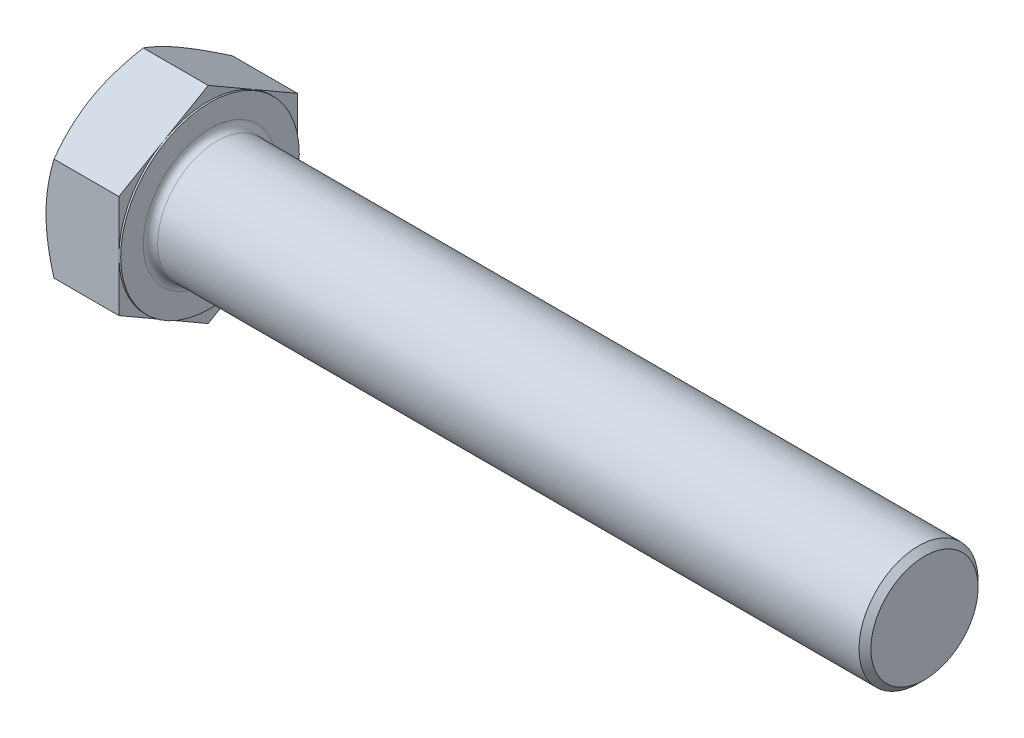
ISO-10303-21;
HEADER;
FILE_DESCRIPTION(('STEP AP214'),'2;1');
FILE_NAME('part.step','',(''),(''),'','','');
FILE_SCHEMA(('AUTOMOTIVE_DESIGN { 1 0 10303 214 1 1 1 1 }'));
ENDSEC;
DATA;
#1=APPLICATION_CONTEXT('core data for automotive mechanical design processes');
#2=APPLICATION_PROTOCOL_DEFINITION('international standard','automotive_design',2000,#1);
#3=PRODUCT_CONTEXT('',#1,'mechanical');
#4=PRODUCT('Part','Part','',(#3));
#5=PRODUCT_RELATED_PRODUCT_CATEGORY('part','',(#4));
#6=PRODUCT_DEFINITION_FORMATION('','',#4);
#7=PRODUCT_DEFINITION_CONTEXT('part definition',#1,'design');
#8=PRODUCT_DEFINITION('design','',#6,#7);
#9=PRODUCT_DEFINITION_SHAPE('','',#8);
#10=(LENGTH_UNIT() NAMED_UNIT(*) SI_UNIT(.MILLI.,.METRE.));
#11=(NAMED_UNIT(*) PLANE_ANGLE_UNIT() SI_UNIT($,.RADIAN.));
#12=(NAMED_UNIT(*) SI_UNIT($,.STERADIAN.) SOLID_ANGLE_UNIT());
#13=UNCERTAINTY_MEASURE_WITH_UNIT(LENGTH_MEASURE(1.E-05),#10,'distance_accuracy_value','');
#14=(GEOMETRIC_REPRESENTATION_CONTEXT(3) GLOBAL_UNCERTAINTY_ASSIGNED_CONTEXT((#13)) GLOBAL_UNIT_ASSIGNED_CONTEXT((#10,
#11,#12)) REPRESENTATION_CONTEXT('',''));
#15=CARTESIAN_POINT('',(0.,0.,0.));
#16=DIRECTION('',(0.,0.,1.));
#17=DIRECTION('',(1.,0.,0.));
#18=AXIS2_PLACEMENT_3D('',#15,#16,#17);
#19=CARTESIAN_POINT('',(15.9258,21.9970452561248,0.));
#20=DIRECTION('',(1.,0.,0.));
#21=DIRECTION('',(0.,0.,-1.));
#22=AXIS2_PLACEMENT_3D('',#19,#20,#21);
#23=PLANE('',#22);
#24=CARTESIAN_POINT('',(15.9258,0.,0.));
#25=DIRECTION('',(1.,0.,0.));
#26=DIRECTION('',(0.,0.,-1.));
#27=AXIS2_PLACEMENT_3D('',#24,#25,#26);
#28=CIRCLE('',#27,14.224);
#29=CARTESIAN_POINT('',(15.9258,0.,-14.224));
#30=VERTEX_POINT('',#29);
#31=EDGE_CURVE('E41',#30,#30,#28,.F.);
#32=ORIENTED_EDGE('',*,*,#31,.T.);
#33=EDGE_LOOP('',(#32));
#34=FACE_BOUND('',#33,.T.);
#35=CARTESIAN_POINT('',(15.9258,0.,0.));
#36=DIRECTION('',(1.,0.,0.));
#37=DIRECTION('',(0.,0.,-1.));
#38=AXIS2_PLACEMENT_3D('',#35,#36,#37);
#39=CIRCLE('',#38,19.05);
#40=CARTESIAN_POINT('',(15.9258,0.,-19.05));
#41=VERTEX_POINT('',#40);
#42=EDGE_CURVE('E298',#41,#41,#39,.T.);
#43=ORIENTED_EDGE('',*,*,#42,.T.);
#44=EDGE_LOOP('',(#43));
#45=FACE_BOUND('',#44,.T.);
#46=ADVANCED_FACE('F33',(#34,#45),#23,.T.);
#47=CARTESIAN_POINT('',(0.,0.,0.));
#48=DIRECTION('',(-1.,0.,0.));
#49=DIRECTION('',(0.,0.,1.));
#50=AXIS2_PLACEMENT_3D('',#47,#48,#49);
#51=CYLINDRICAL_SURFACE('',#50,12.7);
#52=CARTESIAN_POINT('',(17.4498,0.,0.));
#53=DIRECTION('',(1.,0.,0.));
#54=DIRECTION('',(0.,0.,-1.));
#55=AXIS2_PLACEMENT_3D('',#52,#53,#54);
#56=CIRCLE('',#55,12.7);
#57=CARTESIAN_POINT('',(17.4498,0.,-12.7));
#58=VERTEX_POINT('',#57);
#59=EDGE_CURVE('E11',#58,#58,#56,.T.);
#60=ORIENTED_EDGE('',*,*,#59,.T.);
#61=EDGE_LOOP('',(#60));
#62=FACE_BOUND('',#61,.T.);
#63=CARTESIAN_POINT('',(167.05707,0.,0.));
#64=DIRECTION('',(-1.,0.,0.));
#65=DIRECTION('',(0.,0.,1.));
#66=AXIS2_PLACEMENT_3D('',#63,#64,#65);
#67=CIRCLE('',#66,12.7);
#68=CARTESIAN_POINT('',(167.05707,0.,12.7));
#69=VERTEX_POINT('',#68);
#70=EDGE_CURVE('E277',#69,#69,#67,.T.);
#71=ORIENTED_EDGE('',*,*,#70,.T.);
#72=EDGE_LOOP('',(#71));
#73=FACE_BOUND('',#72,.T.);
#74=ADVANCED_FACE('F251',(#62,#73),#51,.T.);
#75=CARTESIAN_POINT('',(168.3258,0.,0.));
#76=DIRECTION('',(-1.,0.,0.));
#77=DIRECTION('',(0.,0.,1.));
#78=AXIS2_PLACEMENT_3D('',#75,#76,#77);
#79=CONICAL_SURFACE('',#78,11.43127,0.785398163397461);
#80=ORIENTED_EDGE('',*,*,#70,.F.);
#81=EDGE_LOOP('',(#80));
#82=FACE_BOUND('',#81,.T.);
#83=CARTESIAN_POINT('',(168.3258,0.,0.));
#84=DIRECTION('',(-1.,0.,0.));
#85=DIRECTION('',(0.,0.,1.));
#86=AXIS2_PLACEMENT_3D('',#83,#84,#85);
#87=CIRCLE('',#86,11.43127);
#88=CARTESIAN_POINT('',(168.3258,0.,11.43127));
#89=VERTEX_POINT('',#88);
#90=EDGE_CURVE('E275',#89,#89,#87,.T.);
#91=ORIENTED_EDGE('',*,*,#90,.T.);
#92=EDGE_LOOP('',(#91));
#93=FACE_BOUND('',#92,.T.);
#94=ADVANCED_FACE('F256',(#82,#93),#79,.T.);
#95=CARTESIAN_POINT('',(168.3258,0.,0.));
#96=DIRECTION('',(-1.,0.,0.));
#97=DIRECTION('',(0.,0.,1.));
#98=AXIS2_PLACEMENT_3D('',#95,#96,#97);
#99=PLANE('',#98);
#100=ORIENTED_EDGE('',*,*,#90,.F.);
#101=EDGE_LOOP('',(#100));
#102=FACE_BOUND('',#101,.T.);
#103=ADVANCED_FACE('F263',(#102),#99,.F.);
#104=CARTESIAN_POINT('',(15.5448,19.05,0.));
#105=DIRECTION('',(1.,0.,0.));
#106=DIRECTION('',(0.,0.,-1.));
#107=AXIS2_PLACEMENT_3D('',#104,#105,#106);
#108=PLANE('',#107);
#109=DIRECTION('',(0.,0.500000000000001,0.866025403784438));
#110=VECTOR('',#109,1.);
#111=CARTESIAN_POINT('',(15.5448,10.9985226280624,-19.05));
#112=LINE('',#111,#110);
#113=CARTESIAN_POINT('',(15.5448,10.9985226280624,-19.05));
#114=VERTEX_POINT('',#113);
#115=CARTESIAN_POINT('',(15.5448,16.4977839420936,-9.52500000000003));
#116=VERTEX_POINT('',#115);
#117=EDGE_CURVE('E165',#114,#116,#112,.T.);
#118=ORIENTED_EDGE('',*,*,#117,.T.);
#119=CARTESIAN_POINT('',(15.5448,0.,0.));
#120=DIRECTION('',(-1.,0.,0.));
#121=DIRECTION('',(0.,0.,1.));
#122=AXIS2_PLACEMENT_3D('',#119,#120,#121);
#123=CIRCLE('',#122,19.05);
#124=CARTESIAN_POINT('',(15.5448,0.,-19.05));
#125=VERTEX_POINT('',#124);
#126=EDGE_CURVE('E48',#116,#125,#123,.T.);
#127=ORIENTED_EDGE('',*,*,#126,.T.);
#128=DIRECTION('',(0.,1.,0.));
#129=VECTOR('',#128,1.);
#130=CARTESIAN_POINT('',(15.5448,10.9985226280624,-19.05));
#131=LINE('',#130,#129);
#132=EDGE_CURVE('E301',#125,#114,#131,.T.);
#133=ORIENTED_EDGE('',*,*,#132,.T.);
#134=EDGE_LOOP('',(#118,#127,#133));
#135=FACE_BOUND('',#134,.T.);
#136=ADVANCED_FACE('F266',(#135),#108,.T.);
#137=CARTESIAN_POINT('',(15.5448,21.9970452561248,0.));
#138=VERTEX_POINT('',#137);
#139=EDGE_CURVE('E163',#116,#138,#112,.T.);
#140=ORIENTED_EDGE('',*,*,#139,.T.);
#141=DIRECTION('',(0.,-0.500000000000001,0.866025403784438));
#142=VECTOR('',#141,1.);
#143=CARTESIAN_POINT('',(15.5448,21.9970452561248,0.));
#144=LINE('',#143,#142);
#145=CARTESIAN_POINT('',(15.5448,16.4977839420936,9.52500000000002));
#146=VERTEX_POINT('',#145);
#147=EDGE_CURVE('E162',#138,#146,#144,.T.);
#148=ORIENTED_EDGE('',*,*,#147,.T.);
#149=EDGE_CURVE('E151',#146,#116,#123,.T.);
#150=ORIENTED_EDGE('',*,*,#149,.T.);
#151=EDGE_LOOP('',(#140,#148,#150));
#152=FACE_BOUND('',#151,.T.);
#153=ADVANCED_FACE('F271',(#152),#108,.T.);
#154=CARTESIAN_POINT('',(15.5448,10.9985226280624,19.05));
#155=VERTEX_POINT('',#154);
#156=EDGE_CURVE('E130',#146,#155,#144,.T.);
#157=ORIENTED_EDGE('',*,*,#156,.T.);
#158=DIRECTION('',(0.,-1.,0.));
#159=VECTOR('',#158,1.);
#160=CARTESIAN_POINT('',(15.5448,10.9985226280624,19.05));
#161=LINE('',#160,#159);
#162=CARTESIAN_POINT('',(15.5448,0.,19.05));
#163=VERTEX_POINT('',#162);
#164=EDGE_CURVE('E124',#155,#163,#161,.T.);
#165=ORIENTED_EDGE('',*,*,#164,.T.);
#166=EDGE_CURVE('E128',#163,#146,#123,.T.);
#167=ORIENTED_EDGE('',*,*,#166,.T.);
#168=EDGE_LOOP('',(#157,#165,#167));
#169=FACE_BOUND('',#168,.T.);
#170=ADVANCED_FACE('F126',(#169),#108,.T.);
#171=CARTESIAN_POINT('',(15.5448,-10.9985226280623,19.05));
#172=VERTEX_POINT('',#171);
#173=EDGE_CURVE('E134',#163,#172,#161,.T.);
#174=ORIENTED_EDGE('',*,*,#173,.T.);
#175=DIRECTION('',(0.,-0.500000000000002,-0.866025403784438));
#176=VECTOR('',#175,1.);
#177=CARTESIAN_POINT('',(15.5448,-21.9970452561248,0.));
#178=LINE('',#177,#176);
#179=CARTESIAN_POINT('',(15.5448,-16.4977839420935,9.52500000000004));
#180=VERTEX_POINT('',#179);
#181=EDGE_CURVE('E141',#172,#180,#178,.T.);
#182=ORIENTED_EDGE('',*,*,#181,.T.);
#183=EDGE_CURVE('E138',#180,#163,#123,.T.);
#184=ORIENTED_EDGE('',*,*,#183,.T.);
#185=EDGE_LOOP('',(#174,#182,#184));
#186=FACE_BOUND('',#185,.T.);
#187=ADVANCED_FACE('F139',(#186),#108,.T.);
#188=CARTESIAN_POINT('',(15.5448,-21.9970452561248,0.));
#189=VERTEX_POINT('',#188);
#190=EDGE_CURVE('E157',#180,#189,#178,.T.);
#191=ORIENTED_EDGE('',*,*,#190,.T.);
#192=DIRECTION('',(0.,0.5,-0.866025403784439));
#193=VECTOR('',#192,1.);
#194=CARTESIAN_POINT('',(15.5448,-10.9985226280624,-19.05));
#195=LINE('',#194,#193);
#196=CARTESIAN_POINT('',(15.5448,-16.4977839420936,-9.525));
#197=VERTEX_POINT('',#196);
#198=EDGE_CURVE('E339',#189,#197,#195,.T.);
#199=ORIENTED_EDGE('',*,*,#198,.T.);
#200=EDGE_CURVE('E145',#197,#180,#123,.T.);
#201=ORIENTED_EDGE('',*,*,#200,.T.);
#202=EDGE_LOOP('',(#191,#199,#201));
#203=FACE_BOUND('',#202,.T.);
#204=ADVANCED_FACE('F340',(#203),#108,.T.);
#205=CARTESIAN_POINT('',(15.5448,-10.9985226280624,-19.05));
#206=VERTEX_POINT('',#205);
#207=EDGE_CURVE('E152',#197,#206,#195,.T.);
#208=ORIENTED_EDGE('',*,*,#207,.T.);
#209=EDGE_CURVE('E302',#206,#125,#131,.T.);
#210=ORIENTED_EDGE('',*,*,#209,.T.);
#211=EDGE_CURVE('E309',#125,#197,#123,.T.);
#212=ORIENTED_EDGE('',*,*,#211,.T.);
#213=EDGE_LOOP('',(#208,#210,#212));
#214=FACE_BOUND('',#213,.T.);
#215=ADVANCED_FACE('F272',(#214),#108,.T.);
#216=CARTESIAN_POINT('',(0.,0.,0.));
#217=DIRECTION('',(-1.,0.,0.));
#218=DIRECTION('',(0.,0.,1.));
#219=AXIS2_PLACEMENT_3D('',#216,#217,#218);
#220=CYLINDRICAL_SURFACE('',#219,19.05);
#221=ORIENTED_EDGE('',*,*,#126,.F.);
#222=ORIENTED_EDGE('',*,*,#149,.F.);
#223=ORIENTED_EDGE('',*,*,#166,.F.);
#224=ORIENTED_EDGE('',*,*,#183,.F.);
#225=ORIENTED_EDGE('',*,*,#200,.F.);
#226=ORIENTED_EDGE('',*,*,#211,.F.);
#227=EDGE_LOOP('',(#221,#222,#223,#224,#225,#226));
#228=FACE_BOUND('',#227,.T.);
#229=ORIENTED_EDGE('',*,*,#42,.F.);
#230=EDGE_LOOP('',(#229));
#231=FACE_BOUND('',#230,.T.);
#232=ADVANCED_FACE('F148',(#228,#231),#220,.T.);
#233=CARTESIAN_POINT('',(0.,21.9970452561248,0.));
#234=DIRECTION('',(1.,0.,0.));
#235=DIRECTION('',(0.,0.,-1.));
#236=AXIS2_PLACEMENT_3D('',#233,#234,#235);
#237=PLANE('',#236);
#238=CARTESIAN_POINT('',(0.,0.,0.));
#239=DIRECTION('',(1.,0.,0.));
#240=DIRECTION('',(0.,0.,-1.));
#241=AXIS2_PLACEMENT_3D('',#238,#239,#240);
#242=CIRCLE('',#241,19.05);
#243=CARTESIAN_POINT('',(0.,0.,-19.05));
#244=VERTEX_POINT('',#243);
#245=CARTESIAN_POINT('',(0.,16.4977839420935,-9.52500000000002));
#246=VERTEX_POINT('',#245);
#247=EDGE_CURVE('E297',#244,#246,#242,.T.);
#248=ORIENTED_EDGE('',*,*,#247,.F.);
#249=CARTESIAN_POINT('',(0.,-16.4977839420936,-9.525));
#250=VERTEX_POINT('',#249);
#251=EDGE_CURVE('E293',#250,#244,#242,.T.);
#252=ORIENTED_EDGE('',*,*,#251,.F.);
#253=CARTESIAN_POINT('',(0.,-16.4977839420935,9.52500000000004));
#254=VERTEX_POINT('',#253);
#255=EDGE_CURVE('E296',#254,#250,#242,.T.);
#256=ORIENTED_EDGE('',*,*,#255,.F.);
#257=CARTESIAN_POINT('',(0.,0.,19.05));
#258=VERTEX_POINT('',#257);
#259=EDGE_CURVE('E332',#258,#254,#242,.T.);
#260=ORIENTED_EDGE('',*,*,#259,.F.);
#261=CARTESIAN_POINT('',(0.,0.,0.));
#262=DIRECTION('',(-1.,0.,0.));
#263=DIRECTION('',(0.,0.,1.));
#264=AXIS2_PLACEMENT_3D('',#261,#262,#263);
#265=CIRCLE('',#264,19.05);
#266=CARTESIAN_POINT('',(0.,16.4977839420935,9.52500000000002));
#267=VERTEX_POINT('',#266);
#268=EDGE_CURVE('E166',#258,#267,#265,.T.);
#269=ORIENTED_EDGE('',*,*,#268,.T.);
#270=EDGE_CURVE('E355',#246,#267,#242,.T.);
#271=ORIENTED_EDGE('',*,*,#270,.F.);
#272=EDGE_LOOP('',(#248,#252,#256,#260,#269,#271));
#273=FACE_BOUND('',#272,.T.);
#274=ADVANCED_FACE('F197',(#273),#237,.F.);
#275=CARTESIAN_POINT('',(0.,0.,0.));
#276=DIRECTION('',(1.,0.,0.));
#277=DIRECTION('',(0.,0.,-1.));
#278=AXIS2_PLACEMENT_3D('',#275,#276,#277);
#279=CONICAL_SURFACE('',#278,19.05,1.0471975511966);
#280=CARTESIAN_POINT('',(1.70154403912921,10.9984071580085,19.0502));
#281=CARTESIAN_POINT('',(1.56198341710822,11.2401500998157,18.6314889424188));
#282=CARTESIAN_POINT('',(1.42875584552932,11.4828359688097,18.2111446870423));
#283=CARTESIAN_POINT('',(1.17672716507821,11.9701537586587,17.3670855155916));
#284=CARTESIAN_POINT('',(1.05793080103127,12.2147862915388,16.9433695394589));
#285=CARTESIAN_POINT('',(0.83636140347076,12.7064702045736,16.0917480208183));
#286=CARTESIAN_POINT('',(0.733626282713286,12.9535258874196,15.6638350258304));
#287=CARTESIAN_POINT('',(0.54638543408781,13.4493539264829,14.8050356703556));
#288=CARTESIAN_POINT('',(0.461878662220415,13.6981261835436,14.374149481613));
#289=CARTESIAN_POINT('',(0.31468882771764,14.1910129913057,13.5204444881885));
#290=CARTESIAN_POINT('',(0.251518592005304,14.4350909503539,13.0976890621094));
#291=CARTESIAN_POINT('',(0.145596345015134,14.9243652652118,12.250241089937));
#292=CARTESIAN_POINT('',(0.102844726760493,15.1695616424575,11.8255485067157));
#293=CARTESIAN_POINT('',(0.0388391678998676,15.6603662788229,10.9754499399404));
#294=CARTESIAN_POINT('',(0.0175596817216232,15.9059736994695,10.5500454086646));
#295=CARTESIAN_POINT('',(-0.00304398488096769,16.397415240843,9.69884369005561));
#296=CARTESIAN_POINT('',(-0.00236884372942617,16.6432493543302,9.27304651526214));
#297=CARTESIAN_POINT('',(0.0194033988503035,17.1028414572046,8.47700964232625));
#298=CARTESIAN_POINT('',(0.037845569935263,17.316632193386,8.10671322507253));
#299=CARTESIAN_POINT('',(0.0909844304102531,17.7437036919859,7.36700369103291));
#300=CARTESIAN_POINT('',(0.125680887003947,17.9569844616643,6.99759056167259));
#301=CARTESIAN_POINT('',(0.210726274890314,18.3829552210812,6.25978756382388));
#302=CARTESIAN_POINT('',(0.261089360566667,18.5956445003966,5.89139892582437));
#303=CARTESIAN_POINT('',(0.376579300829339,19.0200105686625,5.15637533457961));
#304=CARTESIAN_POINT('',(0.441706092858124,19.2316873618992,4.78974037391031));
#305=CARTESIAN_POINT('',(0.660888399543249,19.8742595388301,3.6767727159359));
#306=CARTESIAN_POINT('',(0.836799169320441,20.3032941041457,2.93366305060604));
#307=CARTESIAN_POINT('',(1.23604434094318,21.1549659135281,1.45852420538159));
#308=CARTESIAN_POINT('',(1.45928498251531,21.5776140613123,0.726476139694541));
#309=CARTESIAN_POINT('',(1.70154403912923,21.9971607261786,-0.000200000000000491));
#310=B_SPLINE_CURVE_WITH_KNOTS('',3,(#280,#281,#282,#283,#284,#285,#286,#287,#288,#289,#290,
#291,#292,#293,#294,#295,#296,#297,#298,#299,#300,#301,#302,#303,#304,#305,#306,#307,#308,#309),
.UNSPECIFIED.,.F.,.F.,(4,2,2,2,2,2,2,2,2,2,2,2,2,2,4),(0.,1.50971559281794,3.01992622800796,
4.53364959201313,6.04728623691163,7.52356313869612,8.99986845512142,10.4744153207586,
11.9489166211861,13.2325441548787,14.5161533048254,15.8009255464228,17.085692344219,
19.7118183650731,22.3327898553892),.UNSPECIFIED.);
#311=CARTESIAN_POINT('',(1.70147737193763,21.9970452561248,0.));
#312=VERTEX_POINT('',#311);
#313=EDGE_CURVE('E217',#267,#312,#310,.T.);
#314=ORIENTED_EDGE('',*,*,#313,.T.);
#315=CARTESIAN_POINT('',(1.70154403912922,21.9971607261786,0.0002));
#316=CARTESIAN_POINT('',(1.56198341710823,21.7554177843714,-0.418511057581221));
#317=CARTESIAN_POINT('',(1.42875584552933,21.5127319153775,-0.838855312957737));
#318=CARTESIAN_POINT('',(1.17672716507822,21.0254141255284,-1.68291448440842));
#319=CARTESIAN_POINT('',(1.05793080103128,20.7807815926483,-2.10663046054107));
#320=CARTESIAN_POINT('',(0.836361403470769,20.2890976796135,-2.95825197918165));
#321=CARTESIAN_POINT('',(0.733626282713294,20.0420419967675,-3.38616497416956));
#322=CARTESIAN_POINT('',(0.546385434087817,19.5462139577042,-4.24496432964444));
#323=CARTESIAN_POINT('',(0.46187866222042,19.2974417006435,-4.67585051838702));
#324=CARTESIAN_POINT('',(0.314688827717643,18.8045548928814,-5.52955551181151));
#325=CARTESIAN_POINT('',(0.251518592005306,18.5604769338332,-5.95231093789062));
#326=CARTESIAN_POINT('',(0.145596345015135,18.0712026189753,-6.79975891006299));
#327=CARTESIAN_POINT('',(0.102844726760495,17.8260062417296,-7.22445149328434));
#328=CARTESIAN_POINT('',(0.0388391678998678,17.3352016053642,-8.07455006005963));
#329=CARTESIAN_POINT('',(0.0175596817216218,17.0895941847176,-8.49995459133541));
#330=CARTESIAN_POINT('',(-0.0030439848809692,16.5981526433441,-9.3511563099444));
#331=CARTESIAN_POINT('',(-0.00236884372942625,16.3523185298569,-9.77695348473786));
#332=CARTESIAN_POINT('',(0.0194033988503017,15.8927264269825,-10.5729903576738));
#333=CARTESIAN_POINT('',(0.0378455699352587,15.6789356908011,-10.9432867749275));
#334=CARTESIAN_POINT('',(0.0909844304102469,15.2518641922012,-11.6829963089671));
#335=CARTESIAN_POINT('',(0.125680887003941,15.0385834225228,-12.0524094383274));
#336=CARTESIAN_POINT('',(0.210726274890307,14.612612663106,-12.7902124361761));
#337=CARTESIAN_POINT('',(0.261089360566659,14.3999233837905,-13.1586010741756));
#338=CARTESIAN_POINT('',(0.376579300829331,13.9755573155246,-13.8936246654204));
#339=CARTESIAN_POINT('',(0.441706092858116,13.7638805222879,-14.2602596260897));
#340=CARTESIAN_POINT('',(0.66088839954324,13.121308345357,-15.3732272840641));
#341=CARTESIAN_POINT('',(0.83679916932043,12.6922737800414,-16.116336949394));
#342=CARTESIAN_POINT('',(1.23604434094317,11.840601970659,-17.5914757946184));
#343=CARTESIAN_POINT('',(1.4592849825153,11.4179538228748,-18.3235238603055));
#344=CARTESIAN_POINT('',(1.70154403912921,10.9984071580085,-19.0502));
#345=B_SPLINE_CURVE_WITH_KNOTS('',3,(#315,#316,#317,#318,#319,#320,#321,#322,#323,#324,#325,
#326,#327,#328,#329,#330,#331,#332,#333,#334,#335,#336,#337,#338,#339,#340,#341,#342,#343,#344),
.UNSPECIFIED.,.F.,.F.,(4,2,2,2,2,2,2,2,2,2,2,2,2,2,4),(0.,1.50971559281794,3.01992622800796,
4.53364959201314,6.04728623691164,7.52356313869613,8.99986845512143,10.4744153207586,
11.9489166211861,13.2325441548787,14.5161533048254,15.8009255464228,17.085692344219,
19.7118183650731,22.3327898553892),.UNSPECIFIED.);
#346=EDGE_CURVE('E56',#312,#246,#345,.T.);
#347=ORIENTED_EDGE('',*,*,#346,.T.);
#348=ORIENTED_EDGE('',*,*,#270,.T.);
#349=EDGE_LOOP('',(#314,#347,#348));
#350=FACE_BOUND('',#349,.T.);
#351=ADVANCED_FACE('F356',(#350),#279,.T.);
#352=CARTESIAN_POINT('',(9.36387045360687,-29.6812846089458,19.05));
#353=CARTESIAN_POINT('',(9.16146583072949,-29.2647066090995,19.05));
#354=CARTESIAN_POINT('',(8.96006011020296,-28.8476434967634,19.05));
#355=CARTESIAN_POINT('',(8.55947242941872,-28.0124458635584,19.05));
#356=CARTESIAN_POINT('',(8.36029049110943,-27.5943113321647,19.05));
#357=CARTESIAN_POINT('',(7.76636768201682,-26.3380393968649,19.05));
#358=CARTESIAN_POINT('',(7.37530881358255,-25.498154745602,19.05));
#359=CARTESIAN_POINT('',(6.60327220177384,-23.8083059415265,19.05));
#360=CARTESIAN_POINT('',(6.22235974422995,-22.9583118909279,19.05));
#361=CARTESIAN_POINT('',(5.47593301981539,-21.2516124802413,19.05));
#362=CARTESIAN_POINT('',(5.1104180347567,-20.3949074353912,19.05));
#363=CARTESIAN_POINT('',(4.38719116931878,-18.6452025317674,19.05));
#364=CARTESIAN_POINT('',(4.03012757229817,-17.7519333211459,19.05));
#365=CARTESIAN_POINT('',(3.34269044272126,-15.9549889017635,19.05));
#366=CARTESIAN_POINT('',(3.01231988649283,-15.0513125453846,19.05));
#367=CARTESIAN_POINT('',(2.38684616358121,-13.233792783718,19.05));
#368=CARTESIAN_POINT('',(2.09167277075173,-12.3199737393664,19.05));
#369=CARTESIAN_POINT('',(1.54595671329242,-10.479141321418,19.05));
#370=CARTESIAN_POINT('',(1.29540013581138,-9.55213215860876,19.05));
#371=CARTESIAN_POINT('',(0.962715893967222,-8.15413475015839,19.05));
#372=CARTESIAN_POINT('',(0.859241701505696,-7.68819648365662,19.05));
#373=CARTESIAN_POINT('',(0.667894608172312,-6.75311076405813,19.05));
#374=CARTESIAN_POINT('',(0.58002139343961,-6.28396337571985,19.05));
#375=CARTESIAN_POINT('',(0.42142028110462,-5.34278179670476,19.05));
#376=CARTESIAN_POINT('',(0.35069177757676,-4.87074770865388,19.05));
#377=CARTESIAN_POINT('',(0.227781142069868,-3.92425443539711,19.05));
#378=CARTESIAN_POINT('',(0.175598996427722,-3.44979525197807,19.05));
#379=CARTESIAN_POINT('',(0.091484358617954,-2.50539642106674,19.05));
#380=CARTESIAN_POINT('',(0.0592932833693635,-2.03547994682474,19.05));
#381=CARTESIAN_POINT('',(0.0148196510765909,-1.09470720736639,19.05));
#382=CARTESIAN_POINT('',(0.00253675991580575,-0.62385095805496,19.05));
#383=CARTESIAN_POINT('',(-0.00182781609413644,0.317959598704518,19.05));
#384=CARTESIAN_POINT('',(0.00609054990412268,0.7889139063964,19.05));
#385=CARTESIAN_POINT('',(0.0419336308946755,1.73006593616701,19.05));
#386=CARTESIAN_POINT('',(0.0698592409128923,2.2002636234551,19.05));
#387=CARTESIAN_POINT('',(0.160085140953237,3.32615149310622,19.05));
#388=CARTESIAN_POINT('',(0.231647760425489,3.98111275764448,19.05));
#389=CARTESIAN_POINT('',(0.409728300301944,5.28626871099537,19.05));
#390=CARTESIAN_POINT('',(0.516250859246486,5.93646275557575,19.05));
#391=CARTESIAN_POINT('',(0.760462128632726,7.23143263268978,19.05));
#392=CARTESIAN_POINT('',(0.898174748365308,7.87620391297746,19.05));
#393=CARTESIAN_POINT('',(1.2005558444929,9.15932488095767,19.05));
#394=CARTESIAN_POINT('',(1.36522394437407,9.79767465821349,19.05));
#395=CARTESIAN_POINT('',(1.72141130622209,11.0820581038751,19.05));
#396=CARTESIAN_POINT('',(1.91344522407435,11.727948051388,19.05));
#397=CARTESIAN_POINT('',(2.31762854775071,13.0133672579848,19.05));
#398=CARTESIAN_POINT('',(2.5297780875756,13.6528964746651,19.05));
#399=CARTESIAN_POINT('',(2.97080026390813,14.9259053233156,19.05));
#400=CARTESIAN_POINT('',(3.19966751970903,15.5593868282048,19.05));
#401=CARTESIAN_POINT('',(3.67140575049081,16.8210826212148,19.05));
#402=CARTESIAN_POINT('',(3.91427655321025,17.4492969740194,19.05));
#403=CARTESIAN_POINT('',(4.50783243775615,18.9429543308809,19.05));
#404=CARTESIAN_POINT('',(4.86391009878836,19.8062512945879,19.05));
#405=CARTESIAN_POINT('',(5.59369975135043,21.5253820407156,19.05));
#406=CARTESIAN_POINT('',(5.96741288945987,22.3812153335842,19.05));
#407=CARTESIAN_POINT('',(6.72890710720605,24.0868250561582,19.05));
#408=CARTESIAN_POINT('',(7.11669148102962,24.936600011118,19.05));
#409=CARTESIAN_POINT('',(7.90345923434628,26.6309129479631,19.05));
#410=CARTESIAN_POINT('',(8.30244236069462,27.4754510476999,19.05));
#411=CARTESIAN_POINT('',(9.10995217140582,29.1611257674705,19.05));
#412=CARTESIAN_POINT('',(9.51848919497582,30.0022574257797,19.05));
#413=CARTESIAN_POINT('',(10.3430229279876,31.6808559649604,19.05));
#414=CARTESIAN_POINT('',(10.7590196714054,32.5183228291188,19.05));
#415=CARTESIAN_POINT('',(11.597126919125,34.1900490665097,19.05));
#416=CARTESIAN_POINT('',(12.0192366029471,35.0243088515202,19.05));
#417=CARTESIAN_POINT('',(12.868612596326,36.6901944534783,19.05));
#418=CARTESIAN_POINT('',(13.2958788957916,37.5218202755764,19.05));
#419=CARTESIAN_POINT('',(14.5109176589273,39.8716762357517,19.05));
#420=CARTESIAN_POINT('',(15.3037675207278,41.3872809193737,19.05));
#421=CARTESIAN_POINT('',(16.9002701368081,44.4128482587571,19.05));
#422=CARTESIAN_POINT('',(17.703923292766,45.9228107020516,19.05));
#423=CARTESIAN_POINT('',(19.3174049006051,48.934425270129,19.05));
#424=CARTESIAN_POINT('',(20.1272121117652,50.436088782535,19.05));
#425=CARTESIAN_POINT('',(21.3467150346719,52.6859282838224,19.05));
#426=CARTESIAN_POINT('',(21.7540032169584,53.4354111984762,19.05));
#427=CARTESIAN_POINT('',(22.5700166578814,54.9335928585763,19.05));
#428=CARTESIAN_POINT('',(22.9787419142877,55.6822916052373,19.05));
#429=CARTESIAN_POINT('',(23.3881024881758,56.4306429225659,19.05));
#430=B_SPLINE_CURVE_WITH_KNOTS('',3,(#352,#353,#354,#355,#356,#357,#358,#359,#360,#361,#362,
#363,#364,#365,#366,#367,#368,#369,#370,#371,#372,#373,#374,#375,#376,#377,#378,#379,#380,#381,
#382,#383,#384,#385,#386,#387,#388,#389,#390,#391,#392,#393,#394,#395,#396,#397,#398,#399,#400,
#401,#402,#403,#404,#405,#406,#407,#408,#409,#410,#411,#412,#413,#414,#415,#416,#417,#418,#419,
#420,#421,#422,#423,#424,#425,#426,#427,#428,#429),.UNSPECIFIED.,.F.,.F.,(4,2,2,2,2,2,2,2,2,2,2,
2,2,2,2,2,2,2,2,2,2,2,2,2,2,2,2,2,2,2,2,2,2,2,2,2,2,2,4),(0.,1.38943761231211,2.77888892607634,
5.55819563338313,8.35240254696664,11.1464789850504,14.0321224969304,16.9180873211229,
19.7981940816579,22.6774011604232,24.1090510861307,25.5406722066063,26.9722427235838,
28.40381218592,29.8164561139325,31.2290763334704,32.6417001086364,34.0543870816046,
36.0298747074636,38.0056245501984,39.9828940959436,41.9601360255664,43.9812439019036,
46.0023652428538,48.0228389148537,50.0432877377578,52.8445655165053,55.646025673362,
58.4481459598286,61.2502029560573,64.0554471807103,66.8607041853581,69.6655880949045,
72.4704665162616,77.6017760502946,82.7332769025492,87.8515588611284,90.4105564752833,
92.9695501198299),.UNSPECIFIED.);
#431=CARTESIAN_POINT('',(1.70147737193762,10.9985226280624,19.05));
#432=VERTEX_POINT('',#431);
#433=EDGE_CURVE('E231',#258,#432,#430,.T.);
#434=ORIENTED_EDGE('',*,*,#433,.T.);
#435=EDGE_CURVE('E230',#432,#267,#310,.T.);
#436=ORIENTED_EDGE('',*,*,#435,.T.);
#437=ORIENTED_EDGE('',*,*,#268,.F.);
#438=EDGE_LOOP('',(#434,#436,#437));
#439=FACE_BOUND('',#438,.T.);
#440=ADVANCED_FACE('F326',(#439),#279,.T.);
#441=CARTESIAN_POINT('',(1.70147737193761,-10.9985226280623,19.05));
#442=VERTEX_POINT('',#441);
#443=EDGE_CURVE('E278',#442,#258,#430,.T.);
#444=ORIENTED_EDGE('',*,*,#443,.T.);
#445=ORIENTED_EDGE('',*,*,#259,.T.);
#446=CARTESIAN_POINT('',(1.70154403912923,-21.9971607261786,-0.000200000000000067));
#447=CARTESIAN_POINT('',(1.56198341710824,-21.7554177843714,0.418511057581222));
#448=CARTESIAN_POINT('',(1.42875584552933,-21.5127319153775,0.838855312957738));
#449=CARTESIAN_POINT('',(1.17672716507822,-21.0254141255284,1.68291448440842));
#450=CARTESIAN_POINT('',(1.05793080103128,-20.7807815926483,2.10663046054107));
#451=CARTESIAN_POINT('',(0.836361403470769,-20.2890976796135,2.95825197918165));
#452=CARTESIAN_POINT('',(0.733626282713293,-20.0420419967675,3.38616497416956));
#453=CARTESIAN_POINT('',(0.546385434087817,-19.5462139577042,4.24496432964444));
#454=CARTESIAN_POINT('',(0.461878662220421,-19.2974417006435,4.67585051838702));
#455=CARTESIAN_POINT('',(0.314688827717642,-18.8045548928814,5.5295555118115));
#456=CARTESIAN_POINT('',(0.251518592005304,-18.5604769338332,5.95231093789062));
#457=CARTESIAN_POINT('',(0.145596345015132,-18.0712026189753,6.79975891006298));
#458=CARTESIAN_POINT('',(0.102844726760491,-17.8260062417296,7.22445149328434));
#459=CARTESIAN_POINT('',(0.0388391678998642,-17.3352016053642,8.07455006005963));
#460=CARTESIAN_POINT('',(0.0175596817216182,-17.0895941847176,8.49995459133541));
#461=CARTESIAN_POINT('',(-0.00304398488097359,-16.5981526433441,9.35115630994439));
#462=CARTESIAN_POINT('',(-0.00236884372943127,-16.3523185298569,9.77695348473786));
#463=CARTESIAN_POINT('',(0.0194033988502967,-15.8927264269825,10.5729903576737));
#464=CARTESIAN_POINT('',(0.0378455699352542,-15.6789356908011,10.9432867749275));
#465=CARTESIAN_POINT('',(0.0909844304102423,-15.2518641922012,11.6829963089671));
#466=CARTESIAN_POINT('',(0.125680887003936,-15.0385834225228,12.0524094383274));
#467=CARTESIAN_POINT('',(0.210726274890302,-14.6126126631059,12.7902124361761));
#468=CARTESIAN_POINT('',(0.261089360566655,-14.3999233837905,13.1586010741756));
#469=CARTESIAN_POINT('',(0.376579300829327,-13.9755573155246,13.8936246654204));
#470=CARTESIAN_POINT('',(0.441706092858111,-13.7638805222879,14.2602596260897));
#471=CARTESIAN_POINT('',(0.660888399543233,-13.121308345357,15.3732272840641));
#472=CARTESIAN_POINT('',(0.836799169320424,-12.6922737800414,16.116336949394));
#473=CARTESIAN_POINT('',(1.23604434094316,-11.840601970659,17.5914757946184));
#474=CARTESIAN_POINT('',(1.45928498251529,-11.4179538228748,18.3235238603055));
#475=CARTESIAN_POINT('',(1.70154403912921,-10.9984071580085,19.0502));
#476=B_SPLINE_CURVE_WITH_KNOTS('',3,(#446,#447,#448,#449,#450,#451,#452,#453,#454,#455,#456,
#457,#458,#459,#460,#461,#462,#463,#464,#465,#466,#467,#468,#469,#470,#471,#472,#473,#474,#475),
.UNSPECIFIED.,.F.,.F.,(4,2,2,2,2,2,2,2,2,2,2,2,2,2,4),(0.,1.50971559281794,3.01992622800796,
4.53364959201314,6.04728623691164,7.52356313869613,8.99986845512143,10.4744153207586,
11.9489166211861,13.2325441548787,14.5161533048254,15.8009255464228,17.085692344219,
19.7118183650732,22.3327898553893),.UNSPECIFIED.);
#477=EDGE_CURVE('E219',#254,#442,#476,.T.);
#478=ORIENTED_EDGE('',*,*,#477,.T.);
#479=EDGE_LOOP('',(#444,#445,#478));
#480=FACE_BOUND('',#479,.T.);
#481=ADVANCED_FACE('F186',(#480),#279,.T.);
#482=CARTESIAN_POINT('',(1.70147737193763,-21.9970452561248,0.));
#483=VERTEX_POINT('',#482);
#484=EDGE_CURVE('E211',#483,#254,#476,.T.);
#485=ORIENTED_EDGE('',*,*,#484,.T.);
#486=ORIENTED_EDGE('',*,*,#255,.T.);
#487=CARTESIAN_POINT('',(1.70154403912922,-10.9984071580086,-19.0502));
#488=CARTESIAN_POINT('',(1.56198341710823,-11.2401500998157,-18.6314889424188));
#489=CARTESIAN_POINT('',(1.42875584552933,-11.4828359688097,-18.2111446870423));
#490=CARTESIAN_POINT('',(1.17672716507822,-11.9701537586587,-17.3670855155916));
#491=CARTESIAN_POINT('',(1.05793080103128,-12.2147862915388,-16.9433695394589));
#492=CARTESIAN_POINT('',(0.83636140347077,-12.7064702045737,-16.0917480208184));
#493=CARTESIAN_POINT('',(0.733626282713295,-12.9535258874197,-15.6638350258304));
#494=CARTESIAN_POINT('',(0.54638543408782,-13.449353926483,-14.8050356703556));
#495=CARTESIAN_POINT('',(0.461878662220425,-13.6981261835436,-14.374149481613));
#496=CARTESIAN_POINT('',(0.314688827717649,-14.1910129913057,-13.5204444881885));
#497=CARTESIAN_POINT('',(0.251518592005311,-14.4350909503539,-13.0976890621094));
#498=CARTESIAN_POINT('',(0.145596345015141,-14.9243652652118,-12.250241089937));
#499=CARTESIAN_POINT('',(0.102844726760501,-15.1695616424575,-11.8255485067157));
#500=CARTESIAN_POINT('',(0.0388391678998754,-15.6603662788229,-10.9754499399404));
#501=CARTESIAN_POINT('',(0.0175596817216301,-15.9059736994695,-10.5500454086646));
#502=CARTESIAN_POINT('',(-0.00304398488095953,-16.3974152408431,-9.6988436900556));
#503=CARTESIAN_POINT('',(-0.00236884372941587,-16.6432493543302,-9.27304651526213));
#504=CARTESIAN_POINT('',(0.0194033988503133,-17.1028414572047,-8.47700964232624));
#505=CARTESIAN_POINT('',(0.0378455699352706,-17.316632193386,-8.10671322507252));
#506=CARTESIAN_POINT('',(0.090984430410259,-17.7437036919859,-7.3670036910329));
#507=CARTESIAN_POINT('',(0.125680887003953,-17.9569844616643,-6.99759056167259));
#508=CARTESIAN_POINT('',(0.210726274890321,-18.3829552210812,-6.25978756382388));
#509=CARTESIAN_POINT('',(0.261089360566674,-18.5956445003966,-5.89139892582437));
#510=CARTESIAN_POINT('',(0.376579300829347,-19.0200105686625,-5.1563753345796));
#511=CARTESIAN_POINT('',(0.441706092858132,-19.2316873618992,-4.7897403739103));
#512=CARTESIAN_POINT('',(0.660888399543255,-19.8742595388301,-3.67677271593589));
#513=CARTESIAN_POINT('',(0.836799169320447,-20.3032941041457,-2.93366305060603));
#514=CARTESIAN_POINT('',(1.23604434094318,-21.1549659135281,-1.45852420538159));
#515=CARTESIAN_POINT('',(1.45928498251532,-21.5776140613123,-0.72647613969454));
#516=CARTESIAN_POINT('',(1.70154403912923,-21.9971607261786,0.000200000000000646));
#517=B_SPLINE_CURVE_WITH_KNOTS('',3,(#487,#488,#489,#490,#491,#492,#493,#494,#495,#496,#497,
#498,#499,#500,#501,#502,#503,#504,#505,#506,#507,#508,#509,#510,#511,#512,#513,#514,#515,#516),
.UNSPECIFIED.,.F.,.F.,(4,2,2,2,2,2,2,2,2,2,2,2,2,2,4),(0.,1.50971559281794,3.01992622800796,
4.53364959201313,6.04728623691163,7.52356313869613,8.99986845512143,10.4744153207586,
11.9489166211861,13.2325441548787,14.5161533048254,15.8009255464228,17.085692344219,
19.7118183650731,22.3327898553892),.UNSPECIFIED.);
#518=EDGE_CURVE('E218',#250,#483,#517,.T.);
#519=ORIENTED_EDGE('',*,*,#518,.T.);
#520=EDGE_LOOP('',(#485,#486,#519));
#521=FACE_BOUND('',#520,.T.);
#522=ADVANCED_FACE('F354',(#521),#279,.T.);
#523=CARTESIAN_POINT('',(1.70147737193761,10.9985226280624,-19.05));
#524=VERTEX_POINT('',#523);
#525=EDGE_CURVE('E220',#246,#524,#345,.T.);
#526=ORIENTED_EDGE('',*,*,#525,.T.);
#527=CARTESIAN_POINT('',(9.36387045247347,-29.6812846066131,-19.05));
#528=CARTESIAN_POINT('',(9.16146582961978,-29.264706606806,-19.05));
#529=CARTESIAN_POINT('',(8.96006010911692,-28.8476434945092,-19.05));
#530=CARTESIAN_POINT('',(8.55947242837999,-28.0124458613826,-19.05));
#531=CARTESIAN_POINT('',(8.36029049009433,-27.5943113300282,-19.05));
#532=CARTESIAN_POINT('',(7.76636768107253,-26.3380393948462,-19.05));
#533=CARTESIAN_POINT('',(7.37530881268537,-25.498154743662,-19.05));
#534=CARTESIAN_POINT('',(6.6032722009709,-23.8083059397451,-19.05));
#535=CARTESIAN_POINT('',(6.22235974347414,-22.9583118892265,-19.05));
#536=CARTESIAN_POINT('',(5.47593301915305,-21.2516124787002,-19.05));
#537=CARTESIAN_POINT('',(5.11041803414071,-20.3949074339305,-19.05));
#538=CARTESIAN_POINT('',(4.38719116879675,-18.6452025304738,-19.05));
#539=CARTESIAN_POINT('',(4.03012757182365,-17.751933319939,-19.05));
#540=CARTESIAN_POINT('',(3.3426904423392,-15.9549889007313,-19.05));
#541=CARTESIAN_POINT('',(3.01231988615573,-15.0513125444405,-19.05));
#542=CARTESIAN_POINT('',(2.38684616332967,-13.2337927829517,-19.05));
#543=CARTESIAN_POINT('',(2.09167277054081,-12.3199737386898,-19.05));
#544=CARTESIAN_POINT('',(1.54595671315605,-10.4791413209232,-19.05));
#545=CARTESIAN_POINT('',(1.29540013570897,-9.55213215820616,-19.05));
#546=CARTESIAN_POINT('',(0.962715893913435,-8.15413474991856,-19.05));
#547=CARTESIAN_POINT('',(0.859241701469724,-7.68819648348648,-19.05));
#548=CARTESIAN_POINT('',(0.66789460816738,-6.75311076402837,-19.05));
#549=CARTESIAN_POINT('',(0.580021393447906,-6.28396337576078,-19.05));
#550=CARTESIAN_POINT('',(0.421420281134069,-5.34278179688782,-19.05));
#551=CARTESIAN_POINT('',(0.350691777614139,-4.87074770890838,-19.05));
#552=CARTESIAN_POINT('',(0.227781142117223,-3.92425443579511,-19.05));
#553=CARTESIAN_POINT('',(0.175598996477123,-3.44979525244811,-19.05));
#554=CARTESIAN_POINT('',(0.0914843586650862,-2.50539642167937,-19.05));
#555=CARTESIAN_POINT('',(0.0592932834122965,-2.03547994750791,-19.05));
#556=CARTESIAN_POINT('',(0.0148196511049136,-1.09470720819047,-19.05));
#557=CARTESIAN_POINT('',(0.00253675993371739,-0.623850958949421,-19.05));
#558=CARTESIAN_POINT('',(-0.00182781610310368,0.317959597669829,-19.05));
#559=CARTESIAN_POINT('',(0.00609054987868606,0.788913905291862,-19.05));
#560=CARTESIAN_POINT('',(0.0419336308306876,1.73006593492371,-19.05));
#561=CARTESIAN_POINT('',(0.0698592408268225,2.20026362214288,-19.05));
#562=CARTESIAN_POINT('',(0.160085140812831,3.32615149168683,-19.05));
#563=CARTESIAN_POINT('',(0.231647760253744,3.98111275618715,-19.05));
#564=CARTESIAN_POINT('',(0.409728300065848,5.28626870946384,-19.05));
#565=CARTESIAN_POINT('',(0.516250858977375,5.93646275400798,-19.05));
#566=CARTESIAN_POINT('',(0.760462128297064,7.23143263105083,-19.05));
#567=CARTESIAN_POINT('',(0.898174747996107,7.87620391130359,-19.05));
#568=CARTESIAN_POINT('',(1.20055584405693,9.15932487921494,-19.05));
#569=CARTESIAN_POINT('',(1.36522394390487,9.79767465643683,-19.05));
#570=CARTESIAN_POINT('',(1.72141130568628,11.0820581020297,-19.05));
#571=CARTESIAN_POINT('',(1.91344522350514,11.7279480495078,-19.05));
#572=CARTESIAN_POINT('',(2.31762854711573,13.0133672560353,-19.05));
#573=CARTESIAN_POINT('',(2.52977808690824,13.6528964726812,-19.05));
#574=CARTESIAN_POINT('',(2.97080026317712,14.9259053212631,-19.05));
#575=CARTESIAN_POINT('',(3.19966751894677,15.5593868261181,-19.05));
#576=CARTESIAN_POINT('',(3.67140574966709,16.8210826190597,-19.05));
#577=CARTESIAN_POINT('',(3.91427655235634,17.4492969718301,-19.05));
#578=CARTESIAN_POINT('',(4.50783243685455,18.9429543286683,-19.05));
#579=CARTESIAN_POINT('',(4.86391009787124,19.8062512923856,-19.05));
#580=CARTESIAN_POINT('',(5.59369975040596,21.5253820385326,-19.05));
#581=CARTESIAN_POINT('',(5.96741288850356,22.3812153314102,-19.05));
#582=CARTESIAN_POINT('',(6.7289071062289,24.0868250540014,-19.05));
#583=CARTESIAN_POINT('',(7.11669148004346,24.9366000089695,-19.05));
#584=CARTESIAN_POINT('',(7.90345923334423,26.63091294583,-19.05));
#585=CARTESIAN_POINT('',(8.30244235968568,27.4754510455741,-19.05));
#586=CARTESIAN_POINT('',(9.10995217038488,29.161125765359,-19.05));
#587=CARTESIAN_POINT('',(9.51848919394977,30.0022574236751,-19.05));
#588=CARTESIAN_POINT('',(10.3430229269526,31.6808559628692,-19.05));
#589=CARTESIAN_POINT('',(10.7590196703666,32.5183228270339,-19.05));
#590=CARTESIAN_POINT('',(11.5971269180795,34.1900490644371,-19.05));
#591=CARTESIAN_POINT('',(12.0192366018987,35.0243088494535,-19.05));
#592=CARTESIAN_POINT('',(12.8686125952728,36.690194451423,-19.05));
#593=CARTESIAN_POINT('',(13.2958788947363,37.5218202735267,-19.05));
#594=CARTESIAN_POINT('',(14.510917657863,39.8716762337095,-19.05));
#595=CARTESIAN_POINT('',(15.3037675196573,41.3872809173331,-19.05));
#596=CARTESIAN_POINT('',(16.9002701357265,44.4128482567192,-19.05));
#597=CARTESIAN_POINT('',(17.7039232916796,45.9228107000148,-19.05));
#598=CARTESIAN_POINT('',(19.3174048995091,48.9344252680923,-19.05));
#599=CARTESIAN_POINT('',(20.1272121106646,50.4360887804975,-19.05));
#600=CARTESIAN_POINT('',(21.3467150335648,52.6859282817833,-19.05));
#601=CARTESIAN_POINT('',(21.7540032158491,53.4354111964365,-19.05));
#602=CARTESIAN_POINT('',(22.5700166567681,54.9335928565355,-19.05));
#603=CARTESIAN_POINT('',(22.9787419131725,55.6822916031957,-19.05));
#604=CARTESIAN_POINT('',(23.3881024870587,56.4306429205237,-19.05));
#605=B_SPLINE_CURVE_WITH_KNOTS('',3,(#527,#528,#529,#530,#531,#532,#533,#534,#535,#536,#537,
#538,#539,#540,#541,#542,#543,#544,#545,#546,#547,#548,#549,#550,#551,#552,#553,#554,#555,#556,
#557,#558,#559,#560,#561,#562,#563,#564,#565,#566,#567,#568,#569,#570,#571,#572,#573,#574,#575,
#576,#577,#578,#579,#580,#581,#582,#583,#584,#585,#586,#587,#588,#589,#590,#591,#592,#593,#594,
#595,#596,#597,#598,#599,#600,#601,#602,#603,#604),.UNSPECIFIED.,.F.,.F.,(4,2,2,2,2,2,2,2,2,2,2,
2,2,2,2,2,2,2,2,2,2,2,2,2,2,2,2,2,2,2,2,2,2,2,2,2,2,2,4),(0.,1.38943761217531,2.77888892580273,
5.55819563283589,8.35240254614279,11.1464789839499,14.0321224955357,16.9180873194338,
19.7981940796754,22.6774011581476,24.1090510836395,25.5406722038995,26.9722427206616,
28.4038121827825,29.816456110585,31.2290763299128,32.6417001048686,34.0543870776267,
36.0298747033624,38.0056245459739,39.9828940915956,41.9601360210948,43.9812438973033,
46.0023652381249,48.0228389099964,50.0432877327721,52.8445655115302,55.6460256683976,
58.4481459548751,61.2502029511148,64.0554471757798,66.8607041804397,69.6655880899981,
72.4704665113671,77.6017760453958,82.7332768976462,87.8515588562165,90.410556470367,
92.9695501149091),.UNSPECIFIED.);
#606=EDGE_CURVE('E178',#524,#244,#605,.F.);
#607=ORIENTED_EDGE('',*,*,#606,.T.);
#608=ORIENTED_EDGE('',*,*,#247,.T.);
#609=EDGE_LOOP('',(#526,#607,#608));
#610=FACE_BOUND('',#609,.T.);
#611=ADVANCED_FACE('F351',(#610),#279,.T.);
#612=CARTESIAN_POINT('',(1.70147737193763,-10.9985226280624,-19.05));
#613=VERTEX_POINT('',#612);
#614=EDGE_CURVE('E179',#613,#250,#517,.T.);
#615=ORIENTED_EDGE('',*,*,#614,.T.);
#616=ORIENTED_EDGE('',*,*,#251,.T.);
#617=EDGE_CURVE('E169',#244,#613,#605,.F.);
#618=ORIENTED_EDGE('',*,*,#617,.T.);
#619=EDGE_LOOP('',(#615,#616,#618));
#620=FACE_BOUND('',#619,.T.);
#621=ADVANCED_FACE('F195',(#620),#279,.T.);
#622=CARTESIAN_POINT('',(15.9258,10.9985226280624,-19.05));
#623=DIRECTION('',(0.,0.,1.));
#624=DIRECTION('',(1.,0.,0.));
#625=AXIS2_PLACEMENT_3D('',#622,#623,#624);
#626=PLANE('',#625);
#627=ORIENTED_EDGE('',*,*,#209,.F.);
#628=DIRECTION('',(-1.,0.,0.));
#629=VECTOR('',#628,1.);
#630=CARTESIAN_POINT('',(15.9258,-10.9985226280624,-19.05));
#631=LINE('',#630,#629);
#632=EDGE_CURVE('E284',#206,#613,#631,.T.);
#633=ORIENTED_EDGE('',*,*,#632,.T.);
#634=ORIENTED_EDGE('',*,*,#617,.F.);
#635=ORIENTED_EDGE('',*,*,#606,.F.);
#636=DIRECTION('',(-1.,0.,0.));
#637=VECTOR('',#636,1.);
#638=CARTESIAN_POINT('',(15.9258,10.9985226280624,-19.05));
#639=LINE('',#638,#637);
#640=EDGE_CURVE('E280',#114,#524,#639,.T.);
#641=ORIENTED_EDGE('',*,*,#640,.F.);
#642=ORIENTED_EDGE('',*,*,#132,.F.);
#643=EDGE_LOOP('',(#627,#633,#634,#635,#641,#642));
#644=FACE_BOUND('',#643,.T.);
#645=ADVANCED_FACE('F190',(#644),#626,.F.);
#646=CARTESIAN_POINT('',(15.9258,-10.9985226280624,-19.05));
#647=DIRECTION('',(0.,0.866025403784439,0.5));
#648=DIRECTION('',(0.,-0.5,0.866025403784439));
#649=AXIS2_PLACEMENT_3D('',#646,#647,#648);
#650=PLANE('',#649);
#651=ORIENTED_EDGE('',*,*,#198,.F.);
#652=DIRECTION('',(-1.,0.,0.));
#653=VECTOR('',#652,1.);
#654=CARTESIAN_POINT('',(15.9258,-21.9970452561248,0.));
#655=LINE('',#654,#653);
#656=EDGE_CURVE('E286',#189,#483,#655,.T.);
#657=ORIENTED_EDGE('',*,*,#656,.T.);
#658=ORIENTED_EDGE('',*,*,#518,.F.);
#659=ORIENTED_EDGE('',*,*,#614,.F.);
#660=ORIENTED_EDGE('',*,*,#632,.F.);
#661=ORIENTED_EDGE('',*,*,#207,.F.);
#662=EDGE_LOOP('',(#651,#657,#658,#659,#660,#661));
#663=FACE_BOUND('',#662,.T.);
#664=ADVANCED_FACE('F194',(#663),#650,.F.);
#665=CARTESIAN_POINT('',(15.9258,-21.9970452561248,0.));
#666=DIRECTION('',(0.,0.866025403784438,-0.500000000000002));
#667=DIRECTION('',(0.,0.500000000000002,0.866025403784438));
#668=AXIS2_PLACEMENT_3D('',#665,#666,#667);
#669=PLANE('',#668);
#670=ORIENTED_EDGE('',*,*,#181,.F.);
#671=DIRECTION('',(-1.,0.,0.));
#672=VECTOR('',#671,1.);
#673=CARTESIAN_POINT('',(15.9258,-10.9985226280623,19.05));
#674=LINE('',#673,#672);
#675=EDGE_CURVE('E156',#172,#442,#674,.T.);
#676=ORIENTED_EDGE('',*,*,#675,.T.);
#677=ORIENTED_EDGE('',*,*,#477,.F.);
#678=ORIENTED_EDGE('',*,*,#484,.F.);
#679=ORIENTED_EDGE('',*,*,#656,.F.);
#680=ORIENTED_EDGE('',*,*,#190,.F.);
#681=EDGE_LOOP('',(#670,#676,#677,#678,#679,#680));
#682=FACE_BOUND('',#681,.T.);
#683=ADVANCED_FACE('F202',(#682),#669,.F.);
#684=CARTESIAN_POINT('',(15.9258,10.9985226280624,19.05));
#685=DIRECTION('',(0.,0.,-1.));
#686=DIRECTION('',(0.,1.,0.));
#687=AXIS2_PLACEMENT_3D('',#684,#685,#686);
#688=PLANE('',#687);
#689=ORIENTED_EDGE('',*,*,#164,.F.);
#690=DIRECTION('',(-1.,0.,0.));
#691=VECTOR('',#690,1.);
#692=CARTESIAN_POINT('',(15.9258,10.9985226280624,19.05));
#693=LINE('',#692,#691);
#694=EDGE_CURVE('E289',#155,#432,#693,.T.);
#695=ORIENTED_EDGE('',*,*,#694,.T.);
#696=ORIENTED_EDGE('',*,*,#433,.F.);
#697=ORIENTED_EDGE('',*,*,#443,.F.);
#698=ORIENTED_EDGE('',*,*,#675,.F.);
#699=ORIENTED_EDGE('',*,*,#173,.F.);
#700=EDGE_LOOP('',(#689,#695,#696,#697,#698,#699));
#701=FACE_BOUND('',#700,.T.);
#702=ADVANCED_FACE('F154',(#701),#688,.F.);
#703=CARTESIAN_POINT('',(15.9258,21.9970452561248,0.));
#704=DIRECTION('',(0.,-0.866025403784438,-0.500000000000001));
#705=DIRECTION('',(0.,0.500000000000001,-0.866025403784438));
#706=AXIS2_PLACEMENT_3D('',#703,#704,#705);
#707=PLANE('',#706);
#708=ORIENTED_EDGE('',*,*,#147,.F.);
#709=DIRECTION('',(-1.,0.,0.));
#710=VECTOR('',#709,1.);
#711=CARTESIAN_POINT('',(15.9258,21.9970452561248,0.));
#712=LINE('',#711,#710);
#713=EDGE_CURVE('E291',#138,#312,#712,.T.);
#714=ORIENTED_EDGE('',*,*,#713,.T.);
#715=ORIENTED_EDGE('',*,*,#313,.F.);
#716=ORIENTED_EDGE('',*,*,#435,.F.);
#717=ORIENTED_EDGE('',*,*,#694,.F.);
#718=ORIENTED_EDGE('',*,*,#156,.F.);
#719=EDGE_LOOP('',(#708,#714,#715,#716,#717,#718));
#720=FACE_BOUND('',#719,.T.);
#721=ADVANCED_FACE('F237',(#720),#707,.F.);
#722=CARTESIAN_POINT('',(15.9258,10.9985226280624,-19.05));
#723=DIRECTION('',(0.,-0.866025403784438,0.500000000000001));
#724=DIRECTION('',(0.,-0.500000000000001,-0.866025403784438));
#725=AXIS2_PLACEMENT_3D('',#722,#723,#724);
#726=PLANE('',#725);
#727=ORIENTED_EDGE('',*,*,#117,.F.);
#728=ORIENTED_EDGE('',*,*,#640,.T.);
#729=ORIENTED_EDGE('',*,*,#525,.F.);
#730=ORIENTED_EDGE('',*,*,#346,.F.);
#731=ORIENTED_EDGE('',*,*,#713,.F.);
#732=ORIENTED_EDGE('',*,*,#139,.F.);
#733=EDGE_LOOP('',(#727,#728,#729,#730,#731,#732));
#734=FACE_BOUND('',#733,.T.);
#735=ADVANCED_FACE('F240',(#734),#726,.F.);
#736=CARTESIAN_POINT('',(17.4498,0.,0.));
#737=DIRECTION('',(1.,0.,0.));
#738=DIRECTION('',(0.,0.,-1.));
#739=AXIS2_PLACEMENT_3D('',#736,#737,#738);
#740=TOROIDAL_SURFACE('',#739,14.224,1.524);
#741=ORIENTED_EDGE('',*,*,#59,.F.);
#742=EDGE_LOOP('',(#741));
#743=FACE_BOUND('',#742,.T.);
#744=ORIENTED_EDGE('',*,*,#31,.F.);
#745=EDGE_LOOP('',(#744));
#746=FACE_BOUND('',#745,.T.);
#747=ADVANCED_FACE('F35',(#743,#746),#740,.F.);
#748=CLOSED_SHELL('',(#46,#74,#94,#103,#136,#153,#170,#187,#204,#215,#232,#274,#351,#440,#481,
#522,#611,#621,#645,#664,#683,#702,#721,#735,#747));
#749=MANIFOLD_SOLID_BREP('B2',#748);
#750=ADVANCED_BREP_SHAPE_REPRESENTATION('',(#18,#749),#14);
#751=SHAPE_DEFINITION_REPRESENTATION(#9,#750);
ENDSEC;
END-ISO-10303-21;
